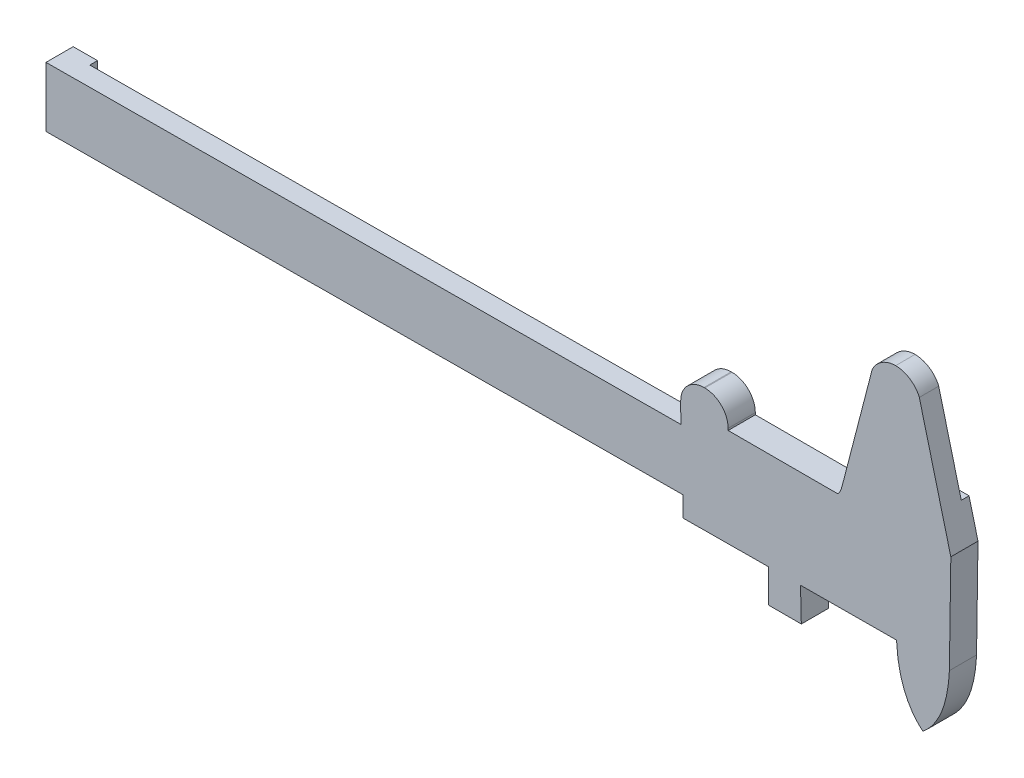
ISO-10303-21;
HEADER;
FILE_DESCRIPTION(('STEP AP214'),'2;1');
FILE_NAME('part.step','',(''),(''),'','','');
FILE_SCHEMA(('AUTOMOTIVE_DESIGN { 1 0 10303 214 1 1 1 1 }'));
ENDSEC;
DATA;
#1=APPLICATION_CONTEXT('core data for automotive mechanical design processes');
#2=APPLICATION_PROTOCOL_DEFINITION('international standard','automotive_design',2000,#1);
#3=PRODUCT_CONTEXT('',#1,'mechanical');
#4=PRODUCT('Part','Part','',(#3));
#5=PRODUCT_RELATED_PRODUCT_CATEGORY('part','',(#4));
#6=PRODUCT_DEFINITION_FORMATION('','',#4);
#7=PRODUCT_DEFINITION_CONTEXT('part definition',#1,'design');
#8=PRODUCT_DEFINITION('design','',#6,#7);
#9=PRODUCT_DEFINITION_SHAPE('','',#8);
#10=(LENGTH_UNIT() NAMED_UNIT(*) SI_UNIT(.MILLI.,.METRE.));
#11=(NAMED_UNIT(*) PLANE_ANGLE_UNIT() SI_UNIT($,.RADIAN.));
#12=(NAMED_UNIT(*) SI_UNIT($,.STERADIAN.) SOLID_ANGLE_UNIT());
#13=UNCERTAINTY_MEASURE_WITH_UNIT(LENGTH_MEASURE(1.E-05),#10,'distance_accuracy_value','');
#14=(GEOMETRIC_REPRESENTATION_CONTEXT(3) GLOBAL_UNCERTAINTY_ASSIGNED_CONTEXT((#13)) GLOBAL_UNIT_ASSIGNED_CONTEXT((#10,
#11,#12)) REPRESENTATION_CONTEXT('',''));
#15=CARTESIAN_POINT('',(0.,0.,0.));
#16=DIRECTION('',(0.,0.,1.));
#17=DIRECTION('',(1.,0.,0.));
#18=AXIS2_PLACEMENT_3D('',#15,#16,#17);
#19=CARTESIAN_POINT('',(234.515118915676,70.7303857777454,7.));
#20=CARTESIAN_POINT('',(233.58508014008,73.106536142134,7.));
#21=CARTESIAN_POINT('',(231.015741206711,74.7747070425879,7.));
#22=CARTESIAN_POINT('',(228.42526925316,74.7747070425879,7.));
#23=B_SPLINE_CURVE_WITH_KNOTS('',3,(#19,#20,#21,#22),.UNSPECIFIED.,.F.,.F.,(4,4),(0.,1.),.UNSPECIFIED.);
#24=DIRECTION('',(0.,0.,-1.));
#25=VECTOR('',#24,1.);
#26=SURFACE_OF_LINEAR_EXTRUSION('',#23,#25);
#27=CARTESIAN_POINT('',(228.42526925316,74.7747070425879,2.));
#28=CARTESIAN_POINT('',(228.61284091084,74.774697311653,2.));
#29=CARTESIAN_POINT('',(228.800236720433,74.7659577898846,2.));
#30=CARTESIAN_POINT('',(229.173447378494,74.731744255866,2.));
#31=CARTESIAN_POINT('',(229.35926268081,74.7062752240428,2.));
#32=CARTESIAN_POINT('',(229.911185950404,74.6061207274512,2.));
#33=CARTESIAN_POINT('',(230.273291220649,74.507675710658,2.));
#34=CARTESIAN_POINT('',(230.799795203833,74.3174038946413,2.));
#35=CARTESIAN_POINT('',(230.972360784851,74.2469685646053,2.));
#36=CARTESIAN_POINT('',(231.31132230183,74.0925268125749,2.));
#37=CARTESIAN_POINT('',(231.477717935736,74.0085197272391,2.));
#38=CARTESIAN_POINT('',(231.966724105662,73.7366141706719,2.));
#39=CARTESIAN_POINT('',(232.278760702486,73.5289743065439,2.));
#40=CARTESIAN_POINT('',(232.725643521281,73.1759121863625,2.));
#41=CARTESIAN_POINT('',(232.874405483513,73.0476111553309,2.));
#42=CARTESIAN_POINT('',(233.160107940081,72.7782908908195,2.));
#43=CARTESIAN_POINT('',(233.297046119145,72.6372691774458,2.));
#44=CARTESIAN_POINT('',(233.557015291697,72.3437063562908,2.));
#45=CARTESIAN_POINT('',(233.680087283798,72.1912015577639,2.));
#46=CARTESIAN_POINT('',(233.911045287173,71.8752017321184,2.));
#47=CARTESIAN_POINT('',(234.018941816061,71.7117144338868,2.));
#48=CARTESIAN_POINT('',(234.195101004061,71.4132749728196,2.));
#49=CARTESIAN_POINT('',(234.266786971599,71.2803362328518,2.));
#50=CARTESIAN_POINT('',(234.399294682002,71.0091723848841,2.));
#51=CARTESIAN_POINT('',(234.460117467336,70.8709477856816,2.));
#52=CARTESIAN_POINT('',(234.515118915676,70.7303857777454,2.));
#53=B_SPLINE_CURVE_WITH_KNOTS('',3,(#27,#28,#29,#30,#31,#32,#33,#34,#35,#36,#37,#38,#39,#40,#41,
#42,#43,#44,#45,#46,#47,#48,#49,#50,#51,#52),.UNSPECIFIED.,.F.,.F.,(4,2,2,2,2,2,2,2,2,2,2,2,4),
(0.,0.562195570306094,1.12422384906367,2.24378081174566,2.8024713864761,3.36118927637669,
4.47986663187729,5.06861782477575,5.65748404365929,6.24456072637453,6.83122849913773,
7.28387239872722,7.73647283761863),.UNSPECIFIED.);
#54=CARTESIAN_POINT('',(228.42526925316,74.7747070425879,2.));
#55=VERTEX_POINT('',#54);
#56=CARTESIAN_POINT('',(234.515118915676,70.7303857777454,2.));
#57=VERTEX_POINT('',#56);
#58=EDGE_CURVE('E236',#55,#57,#53,.T.);
#59=ORIENTED_EDGE('',*,*,#58,.F.);
#60=DIRECTION('',(0.,0.,-1.));
#61=VECTOR('',#60,1.);
#62=CARTESIAN_POINT('',(228.42526925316,74.7747070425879,7.));
#63=LINE('',#62,#61);
#64=CARTESIAN_POINT('',(228.42526925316,74.7747070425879,7.));
#65=VERTEX_POINT('',#64);
#66=EDGE_CURVE('E431',#65,#55,#63,.T.);
#67=ORIENTED_EDGE('',*,*,#66,.F.);
#68=CARTESIAN_POINT('',(234.515118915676,70.7303857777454,7.));
#69=VERTEX_POINT('',#68);
#70=EDGE_CURVE('E375',#69,#65,#23,.T.);
#71=ORIENTED_EDGE('',*,*,#70,.F.);
#72=DIRECTION('',(0.,0.,-1.));
#73=VECTOR('',#72,1.);
#74=CARTESIAN_POINT('',(234.515118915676,70.7303857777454,7.));
#75=LINE('',#74,#73);
#76=EDGE_CURVE('E556',#69,#57,#75,.T.);
#77=ORIENTED_EDGE('',*,*,#76,.T.);
#78=EDGE_LOOP('',(#59,#67,#71,#77));
#79=FACE_BOUND('',#78,.T.);
#80=ADVANCED_FACE('F39',(#79),#26,.F.);
#81=CARTESIAN_POINT('',(228.42526925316,74.7747070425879,7.));
#82=CARTESIAN_POINT('',(225.834797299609,74.7747070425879,7.));
#83=CARTESIAN_POINT('',(223.265458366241,73.106536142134,7.));
#84=CARTESIAN_POINT('',(222.335419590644,70.7303857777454,7.));
#85=B_SPLINE_CURVE_WITH_KNOTS('',3,(#81,#82,#83,#84),.UNSPECIFIED.,.F.,.F.,(4,4),(0.,1.),.UNSPECIFIED.);
#86=DIRECTION('',(0.,0.,-1.));
#87=VECTOR('',#86,1.);
#88=SURFACE_OF_LINEAR_EXTRUSION('',#85,#87);
#89=CARTESIAN_POINT('',(222.335419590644,70.7303857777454,2.));
#90=CARTESIAN_POINT('',(222.399511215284,70.8942071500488,2.));
#91=CARTESIAN_POINT('',(222.471522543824,71.0548455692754,2.));
#92=CARTESIAN_POINT('',(222.630026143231,71.3686158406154,2.));
#93=CARTESIAN_POINT('',(222.716503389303,71.5217552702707,2.));
#94=CARTESIAN_POINT('',(222.902198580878,71.8188980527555,2.));
#95=CARTESIAN_POINT('',(223.001342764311,71.9629476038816,2.));
#96=CARTESIAN_POINT('',(223.211461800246,72.2421308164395,2.));
#97=CARTESIAN_POINT('',(223.322440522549,72.3772615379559,2.));
#98=CARTESIAN_POINT('',(223.670449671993,72.7673552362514,2.));
#99=CARTESIAN_POINT('',(223.92345071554,73.0084311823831,2.));
#100=CARTESIAN_POINT('',(224.328042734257,73.3388756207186,2.));
#101=CARTESIAN_POINT('',(224.46727108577,73.4439363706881,2.));
#102=CARTESIAN_POINT('',(224.75342370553,73.6434155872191,2.));
#103=CARTESIAN_POINT('',(224.900356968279,73.7378211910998,2.));
#104=CARTESIAN_POINT('',(225.378110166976,74.0201243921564,2.));
#105=CARTESIAN_POINT('',(225.721581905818,74.1870949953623,2.));
#106=CARTESIAN_POINT('',(226.431208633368,74.4622961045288,2.));
#107=CARTESIAN_POINT('',(226.797342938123,74.570579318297,2.));
#108=CARTESIAN_POINT('',(227.272931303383,74.6674277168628,2.));
#109=CARTESIAN_POINT('',(227.37672053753,74.6859657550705,2.));
#110=CARTESIAN_POINT('',(227.585004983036,74.7179072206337,2.));
#111=CARTESIAN_POINT('',(227.689499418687,74.7313155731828,2.));
#112=CARTESIAN_POINT('',(227.899010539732,74.7528737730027,2.));
#113=CARTESIAN_POINT('',(228.004027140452,74.7610244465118,2.));
#114=CARTESIAN_POINT('',(228.214448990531,74.7719445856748,2.));
#115=CARTESIAN_POINT('',(228.31985453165,74.7747084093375,2.));
#116=CARTESIAN_POINT('',(228.42526925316,74.7747070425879,2.));
#117=B_SPLINE_CURVE_WITH_KNOTS('',3,(#89,#90,#91,#92,#93,#94,#95,#96,#97,#98,#99,#100,#101,#102,
#103,#104,#105,#106,#107,#108,#109,#110,#111,#112,#113,#114,#115,#116),.UNSPECIFIED.,.F.,.F.,(4,
2,2,2,2,2,2,2,2,2,2,2,2,4),(0.,0.527414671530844,1.05428491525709,1.57821613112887,
2.10231919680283,3.1455656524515,3.66844808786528,4.19195513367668,5.33237842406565,
6.47177578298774,6.78799240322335,7.10390464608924,7.41976723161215,7.73596046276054),.UNSPECIFIED.);
#118=CARTESIAN_POINT('',(222.335419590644,70.7303857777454,2.));
#119=VERTEX_POINT('',#118);
#120=EDGE_CURVE('E282',#119,#55,#117,.T.);
#121=ORIENTED_EDGE('',*,*,#120,.F.);
#122=DIRECTION('',(0.,0.,-1.));
#123=VECTOR('',#122,1.);
#124=CARTESIAN_POINT('',(222.335419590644,70.7303857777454,7.));
#125=LINE('',#124,#123);
#126=CARTESIAN_POINT('',(222.335419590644,70.7303857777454,7.));
#127=VERTEX_POINT('',#126);
#128=EDGE_CURVE('E426',#127,#119,#125,.T.);
#129=ORIENTED_EDGE('',*,*,#128,.F.);
#130=EDGE_CURVE('E381',#65,#127,#85,.T.);
#131=ORIENTED_EDGE('',*,*,#130,.F.);
#132=ORIENTED_EDGE('',*,*,#66,.T.);
#133=EDGE_LOOP('',(#121,#129,#131,#132));
#134=FACE_BOUND('',#133,.T.);
#135=ADVANCED_FACE('F363',(#134),#88,.F.);
#136=CARTESIAN_POINT('',(230.283744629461,4.42310895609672,0.));
#137=DIRECTION('',(0.,0.,-1.));
#138=DIRECTION('',(-1.,0.,0.));
#139=AXIS2_PLACEMENT_3D('',#136,#137,#138);
#140=PLANE('',#139);
#141=DIRECTION('',(-1.,0.,0.));
#142=VECTOR('',#141,1.);
#143=CARTESIAN_POINT('',(240.325064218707,48.1834965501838,0.));
#144=LINE('',#143,#142);
#145=CARTESIAN_POINT('',(240.325064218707,48.1834965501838,0.));
#146=VERTEX_POINT('',#145);
#147=CARTESIAN_POINT('',(216.491232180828,48.1834965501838,0.));
#148=VERTEX_POINT('',#147);
#149=EDGE_CURVE('E433',#146,#148,#144,.T.);
#150=ORIENTED_EDGE('',*,*,#149,.F.);
#151=DIRECTION('',(-0.249531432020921,0.968366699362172,0.));
#152=VECTOR('',#151,1.);
#153=CARTESIAN_POINT('',(234.515118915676,70.7303857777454,0.));
#154=LINE('',#153,#152);
#155=CARTESIAN_POINT('',(242.634280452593,39.2220279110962,0.));
#156=VERTEX_POINT('',#155);
#157=EDGE_CURVE('E246',#156,#146,#154,.T.);
#158=ORIENTED_EDGE('',*,*,#157,.F.);
#159=DIRECTION('',(0.0146565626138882,0.999892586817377,0.));
#160=VECTOR('',#159,1.);
#161=CARTESIAN_POINT('',(242.634280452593,39.2220279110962,0.));
#162=LINE('',#161,#160);
#163=CARTESIAN_POINT('',(242.259332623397,13.6425271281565,0.));
#164=VERTEX_POINT('',#163);
#165=EDGE_CURVE('E450',#164,#156,#162,.T.);
#166=ORIENTED_EDGE('',*,*,#165,.F.);
#167=CARTESIAN_POINT('',(235.449522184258,-3.30660845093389,0.));
#168=CARTESIAN_POINT('',(240.450788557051,0.848930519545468,0.));
#169=CARTESIAN_POINT('',(241.95372581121,7.50072047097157,0.));
#170=CARTESIAN_POINT('',(242.259332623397,13.6425271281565,0.));
#171=B_SPLINE_CURVE_WITH_KNOTS('',3,(#167,#168,#169,#170),.UNSPECIFIED.,.F.,.F.,(4,4),(0.,1.),.UNSPECIFIED.);
#172=CARTESIAN_POINT('',(235.449522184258,-3.30660845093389,0.));
#173=VERTEX_POINT('',#172);
#174=EDGE_CURVE('E637',#173,#164,#171,.T.);
#175=ORIENTED_EDGE('',*,*,#174,.F.);
#176=CARTESIAN_POINT('',(228.639711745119,13.6425271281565,0.));
#177=CARTESIAN_POINT('',(228.945318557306,7.50072047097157,0.));
#178=CARTESIAN_POINT('',(230.448255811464,0.848930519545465,0.));
#179=CARTESIAN_POINT('',(235.449522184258,-3.30660845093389,0.));
#180=B_SPLINE_CURVE_WITH_KNOTS('',3,(#176,#177,#178,#179),.UNSPECIFIED.,.F.,.F.,(4,4),(0.,1.),.UNSPECIFIED.);
#181=CARTESIAN_POINT('',(228.639711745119,13.6425271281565,0.));
#182=VERTEX_POINT('',#181);
#183=EDGE_CURVE('E314',#182,#173,#180,.T.);
#184=ORIENTED_EDGE('',*,*,#183,.F.);
#185=DIRECTION('',(0.999988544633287,0.00478650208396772,0.));
#186=VECTOR('',#185,1.);
#187=CARTESIAN_POINT('',(228.639711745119,13.6425271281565,0.));
#188=LINE('',#187,#186);
#189=CARTESIAN_POINT('',(203.908091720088,13.5241478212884,0.));
#190=VERTEX_POINT('',#189);
#191=EDGE_CURVE('E332',#190,#182,#188,.T.);
#192=ORIENTED_EDGE('',*,*,#191,.F.);
#193=DIRECTION('',(-0.0244575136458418,0.999700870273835,0.));
#194=VECTOR('',#193,1.);
#195=CARTESIAN_POINT('',(204.117476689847,4.96553718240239,0.));
#196=LINE('',#195,#194);
#197=CARTESIAN_POINT('',(204.117476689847,4.96553718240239,0.));
#198=VERTEX_POINT('',#197);
#199=EDGE_CURVE('E495',#198,#190,#196,.T.);
#200=ORIENTED_EDGE('',*,*,#199,.F.);
#201=DIRECTION('',(1.,0.,0.));
#202=VECTOR('',#201,1.);
#203=CARTESIAN_POINT('',(195.684032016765,4.96553718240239,0.));
#204=LINE('',#203,#202);
#205=CARTESIAN_POINT('',(195.684032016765,4.96553718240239,0.));
#206=VERTEX_POINT('',#205);
#207=EDGE_CURVE('E492',#206,#198,#204,.T.);
#208=ORIENTED_EDGE('',*,*,#207,.F.);
#209=DIRECTION('',(0.00676219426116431,-0.999977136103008,0.));
#210=VECTOR('',#209,1.);
#211=CARTESIAN_POINT('',(195.626213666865,13.5155766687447,0.));
#212=LINE('',#211,#210);
#213=CARTESIAN_POINT('',(195.626213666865,13.5155766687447,0.));
#214=VERTEX_POINT('',#213);
#215=EDGE_CURVE('E489',#214,#206,#212,.T.);
#216=ORIENTED_EDGE('',*,*,#215,.F.);
#217=DIRECTION('',(0.999977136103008,0.00676219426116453,0.));
#218=VECTOR('',#217,1.);
#219=CARTESIAN_POINT('',(195.626213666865,13.5155766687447,0.));
#220=LINE('',#219,#218);
#221=CARTESIAN_POINT('',(173.639711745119,13.3668962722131,0.));
#222=VERTEX_POINT('',#221);
#223=EDGE_CURVE('E486',#222,#214,#220,.T.);
#224=ORIENTED_EDGE('',*,*,#223,.F.);
#225=DIRECTION('',(0.,-1.,0.));
#226=VECTOR('',#225,1.);
#227=CARTESIAN_POINT('',(173.639711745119,13.3668962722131,0.));
#228=LINE('',#227,#226);
#229=CARTESIAN_POINT('',(173.639711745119,18.5658586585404,0.));
#230=VERTEX_POINT('',#229);
#231=EDGE_CURVE('E483',#230,#222,#228,.T.);
#232=ORIENTED_EDGE('',*,*,#231,.F.);
#233=DIRECTION('',(0.03661170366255,-0.99932956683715,0.));
#234=VECTOR('',#233,1.);
#235=CARTESIAN_POINT('',(173.639711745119,18.5658586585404,0.));
#236=LINE('',#235,#234);
#237=CARTESIAN_POINT('',(173.07482676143,33.9845966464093,0.));
#238=VERTEX_POINT('',#237);
#239=EDGE_CURVE('E295',#238,#230,#236,.T.);
#240=ORIENTED_EDGE('',*,*,#239,.F.);
#241=DIRECTION('',(0.00609997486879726,-0.999981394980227,0.));
#242=VECTOR('',#241,1.);
#243=CARTESIAN_POINT('',(173.07482676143,33.9845966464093,0.));
#244=LINE('',#243,#242);
#245=CARTESIAN_POINT('',(173.043210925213,39.167445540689,0.));
#246=VERTEX_POINT('',#245);
#247=EDGE_CURVE('E469',#246,#238,#244,.T.);
#248=ORIENTED_EDGE('',*,*,#247,.F.);
#249=CARTESIAN_POINT('',(179.043099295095,39.2040453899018,0.));
#250=DIRECTION('',(0.,0.,-1.));
#251=DIRECTION('',(-1.,0.,0.));
#252=AXIS2_PLACEMENT_3D('',#249,#250,#251);
#253=CIRCLE('',#252,6.);
#254=CARTESIAN_POINT('',(179.043099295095,45.2040453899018,0.));
#255=VERTEX_POINT('',#254);
#256=EDGE_CURVE('E577',#246,#255,#253,.T.);
#257=ORIENTED_EDGE('',*,*,#256,.T.);
#258=DIRECTION('',(-1.,0.,0.));
#259=VECTOR('',#258,1.);
#260=CARTESIAN_POINT('',(173.006387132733,45.2040453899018,0.));
#261=LINE('',#260,#259);
#262=CARTESIAN_POINT('',(179.266703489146,45.2040453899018,0.));
#263=VERTEX_POINT('',#262);
#264=EDGE_CURVE('E465',#263,#255,#261,.T.);
#265=ORIENTED_EDGE('',*,*,#264,.F.);
#266=CARTESIAN_POINT('',(179.266703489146,39.2040453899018,0.));
#267=DIRECTION('',(0.,0.,-1.));
#268=DIRECTION('',(-1.,0.,0.));
#269=AXIS2_PLACEMENT_3D('',#266,#267,#268);
#270=CIRCLE('',#269,6.);
#271=CARTESIAN_POINT('',(185.266703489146,39.2040453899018,0.));
#272=VERTEX_POINT('',#271);
#273=EDGE_CURVE('E574',#263,#272,#270,.T.);
#274=ORIENTED_EDGE('',*,*,#273,.T.);
#275=DIRECTION('',(0.,1.,0.));
#276=VECTOR('',#275,1.);
#277=CARTESIAN_POINT('',(185.266703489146,45.2040453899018,0.));
#278=LINE('',#277,#276);
#279=CARTESIAN_POINT('',(185.266703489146,38.7228694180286,0.));
#280=VERTEX_POINT('',#279);
#281=EDGE_CURVE('E461',#280,#272,#278,.T.);
#282=ORIENTED_EDGE('',*,*,#281,.F.);
#283=DIRECTION('',(-1.,0.,0.));
#284=VECTOR('',#283,1.);
#285=CARTESIAN_POINT('',(185.266703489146,38.7228694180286,0.));
#286=LINE('',#285,#284);
#287=CARTESIAN_POINT('',(213.478853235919,38.7228694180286,0.));
#288=VERTEX_POINT('',#287);
#289=EDGE_CURVE('E448',#288,#280,#286,.T.);
#290=ORIENTED_EDGE('',*,*,#289,.F.);
#291=CARTESIAN_POINT('',(214.677418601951,41.185799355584,0.));
#292=CARTESIAN_POINT('',(214.439289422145,40.267096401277,0.));
#293=CARTESIAN_POINT('',(214.230563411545,39.4059765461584,0.));
#294=CARTESIAN_POINT('',(213.478853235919,38.7228694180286,0.));
#295=B_SPLINE_CURVE_WITH_KNOTS('',3,(#291,#292,#293,#294),.UNSPECIFIED.,.F.,.F.,(4,4),(0.,1.),.UNSPECIFIED.);
#296=CARTESIAN_POINT('',(214.677418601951,41.185799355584,0.));
#297=VERTEX_POINT('',#296);
#298=EDGE_CURVE('E441',#297,#288,#295,.T.);
#299=ORIENTED_EDGE('',*,*,#298,.F.);
#300=DIRECTION('',(-0.250909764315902,-0.96801048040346,0.));
#301=VECTOR('',#300,1.);
#302=CARTESIAN_POINT('',(222.335419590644,70.7303857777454,0.));
#303=LINE('',#302,#301);
#304=EDGE_CURVE('E439',#148,#297,#303,.T.);
#305=ORIENTED_EDGE('',*,*,#304,.F.);
#306=EDGE_LOOP('',(#150,#158,#166,#175,#184,#192,#200,#208,#216,#224,#232,#240,#248,#257,#265,
#274,#282,#290,#299,#305));
#307=FACE_BOUND('',#306,.T.);
#308=ADVANCED_FACE('F345',(#307),#140,.T.);
#309=CARTESIAN_POINT('',(228.639711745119,13.6425271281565,7.));
#310=CARTESIAN_POINT('',(228.945318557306,7.50072047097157,7.));
#311=CARTESIAN_POINT('',(230.448255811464,0.848930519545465,7.));
#312=CARTESIAN_POINT('',(235.449522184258,-3.30660845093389,7.));
#313=B_SPLINE_CURVE_WITH_KNOTS('',3,(#309,#310,#311,#312),.UNSPECIFIED.,.F.,.F.,(4,4),(0.,1.),.UNSPECIFIED.);
#314=DIRECTION('',(0.,0.,-1.));
#315=VECTOR('',#314,1.);
#316=SURFACE_OF_LINEAR_EXTRUSION('',#313,#315);
#317=ORIENTED_EDGE('',*,*,#183,.T.);
#318=DIRECTION('',(0.,0.,-1.));
#319=VECTOR('',#318,1.);
#320=CARTESIAN_POINT('',(235.449522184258,-3.30660845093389,7.));
#321=LINE('',#320,#319);
#322=CARTESIAN_POINT('',(235.449522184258,-3.30660845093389,7.));
#323=VERTEX_POINT('',#322);
#324=EDGE_CURVE('E566',#323,#173,#321,.T.);
#325=ORIENTED_EDGE('',*,*,#324,.F.);
#326=CARTESIAN_POINT('',(228.639711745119,13.6425271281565,7.));
#327=VERTEX_POINT('',#326);
#328=EDGE_CURVE('E324',#327,#323,#313,.T.);
#329=ORIENTED_EDGE('',*,*,#328,.F.);
#330=DIRECTION('',(0.,0.,-1.));
#331=VECTOR('',#330,1.);
#332=CARTESIAN_POINT('',(228.639711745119,13.6425271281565,7.));
#333=LINE('',#332,#331);
#334=EDGE_CURVE('E500',#327,#182,#333,.T.);
#335=ORIENTED_EDGE('',*,*,#334,.T.);
#336=EDGE_LOOP('',(#317,#325,#329,#335));
#337=FACE_BOUND('',#336,.T.);
#338=ADVANCED_FACE('F341',(#337),#316,.F.);
#339=CARTESIAN_POINT('',(235.449522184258,-3.30660845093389,7.));
#340=CARTESIAN_POINT('',(240.450788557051,0.848930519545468,7.));
#341=CARTESIAN_POINT('',(241.95372581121,7.50072047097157,7.));
#342=CARTESIAN_POINT('',(242.259332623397,13.6425271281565,7.));
#343=B_SPLINE_CURVE_WITH_KNOTS('',3,(#339,#340,#341,#342),.UNSPECIFIED.,.F.,.F.,(4,4),(0.,1.),.UNSPECIFIED.);
#344=DIRECTION('',(0.,0.,-1.));
#345=VECTOR('',#344,1.);
#346=SURFACE_OF_LINEAR_EXTRUSION('',#343,#345);
#347=ORIENTED_EDGE('',*,*,#174,.T.);
#348=DIRECTION('',(0.,0.,-1.));
#349=VECTOR('',#348,1.);
#350=CARTESIAN_POINT('',(242.259332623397,13.6425271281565,7.));
#351=LINE('',#350,#349);
#352=CARTESIAN_POINT('',(242.259332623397,13.6425271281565,7.));
#353=VERTEX_POINT('',#352);
#354=EDGE_CURVE('E562',#353,#164,#351,.T.);
#355=ORIENTED_EDGE('',*,*,#354,.F.);
#356=EDGE_CURVE('E331',#323,#353,#343,.T.);
#357=ORIENTED_EDGE('',*,*,#356,.F.);
#358=ORIENTED_EDGE('',*,*,#324,.T.);
#359=EDGE_LOOP('',(#347,#355,#357,#358));
#360=FACE_BOUND('',#359,.T.);
#361=ADVANCED_FACE('F344',(#360),#346,.F.);
#362=CARTESIAN_POINT('',(242.634280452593,39.2220279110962,7.));
#363=DIRECTION('',(-0.999892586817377,0.0146565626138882,0.));
#364=DIRECTION('',(-0.0146565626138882,-0.999892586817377,0.));
#365=AXIS2_PLACEMENT_3D('',#362,#363,#364);
#366=PLANE('',#365);
#367=ORIENTED_EDGE('',*,*,#165,.T.);
#368=DIRECTION('',(0.,0.,-1.));
#369=VECTOR('',#368,1.);
#370=CARTESIAN_POINT('',(242.634280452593,39.2220279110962,7.));
#371=LINE('',#370,#369);
#372=CARTESIAN_POINT('',(242.634280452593,39.2220279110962,7.));
#373=VERTEX_POINT('',#372);
#374=EDGE_CURVE('E559',#373,#156,#371,.T.);
#375=ORIENTED_EDGE('',*,*,#374,.F.);
#376=DIRECTION('',(0.0146565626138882,0.999892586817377,0.));
#377=VECTOR('',#376,1.);
#378=CARTESIAN_POINT('',(242.634280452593,39.2220279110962,7.));
#379=LINE('',#378,#377);
#380=EDGE_CURVE('E629',#353,#373,#379,.T.);
#381=ORIENTED_EDGE('',*,*,#380,.F.);
#382=ORIENTED_EDGE('',*,*,#354,.T.);
#383=EDGE_LOOP('',(#367,#375,#381,#382));
#384=FACE_BOUND('',#383,.T.);
#385=ADVANCED_FACE('F421',(#384),#366,.F.);
#386=CARTESIAN_POINT('',(234.515118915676,70.7303857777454,7.));
#387=DIRECTION('',(-0.968366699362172,-0.249531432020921,0.));
#388=DIRECTION('',(0.249531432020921,-0.968366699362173,0.));
#389=AXIS2_PLACEMENT_3D('',#386,#387,#388);
#390=PLANE('',#389);
#391=ORIENTED_EDGE('',*,*,#157,.T.);
#392=DIRECTION('',(0.,0.,-1.));
#393=VECTOR('',#392,1.);
#394=CARTESIAN_POINT('',(240.325064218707,48.1834965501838,2.));
#395=LINE('',#394,#393);
#396=CARTESIAN_POINT('',(240.325064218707,48.1834965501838,2.));
#397=VERTEX_POINT('',#396);
#398=EDGE_CURVE('E224',#397,#146,#395,.T.);
#399=ORIENTED_EDGE('',*,*,#398,.F.);
#400=DIRECTION('',(0.249531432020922,-0.968366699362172,0.));
#401=VECTOR('',#400,1.);
#402=CARTESIAN_POINT('',(240.325064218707,48.1834965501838,2.));
#403=LINE('',#402,#401);
#404=EDGE_CURVE('E231',#57,#397,#403,.T.);
#405=ORIENTED_EDGE('',*,*,#404,.F.);
#406=ORIENTED_EDGE('',*,*,#76,.F.);
#407=DIRECTION('',(-0.249531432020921,0.968366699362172,0.));
#408=VECTOR('',#407,1.);
#409=CARTESIAN_POINT('',(234.515118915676,70.7303857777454,7.));
#410=LINE('',#409,#408);
#411=EDGE_CURVE('E382',#373,#69,#410,.T.);
#412=ORIENTED_EDGE('',*,*,#411,.F.);
#413=ORIENTED_EDGE('',*,*,#374,.T.);
#414=EDGE_LOOP('',(#391,#399,#405,#406,#412,#413));
#415=FACE_BOUND('',#414,.T.);
#416=ADVANCED_FACE('F243',(#415),#390,.F.);
#417=CARTESIAN_POINT('',(222.335419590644,70.7303857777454,7.));
#418=DIRECTION('',(0.96801048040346,-0.250909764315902,0.));
#419=DIRECTION('',(0.250909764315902,0.96801048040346,0.));
#420=AXIS2_PLACEMENT_3D('',#417,#418,#419);
#421=PLANE('',#420);
#422=DIRECTION('',(0.250909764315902,0.96801048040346,0.));
#423=VECTOR('',#422,1.);
#424=CARTESIAN_POINT('',(222.335419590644,70.7303857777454,2.));
#425=LINE('',#424,#423);
#426=CARTESIAN_POINT('',(216.491232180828,48.1834965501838,2.));
#427=VERTEX_POINT('',#426);
#428=EDGE_CURVE('E230',#427,#119,#425,.T.);
#429=ORIENTED_EDGE('',*,*,#428,.F.);
#430=DIRECTION('',(0.,0.,-1.));
#431=VECTOR('',#430,1.);
#432=CARTESIAN_POINT('',(216.491232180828,48.1834965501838,2.));
#433=LINE('',#432,#431);
#434=EDGE_CURVE('E227',#427,#148,#433,.T.);
#435=ORIENTED_EDGE('',*,*,#434,.T.);
#436=ORIENTED_EDGE('',*,*,#304,.T.);
#437=DIRECTION('',(0.,0.,-1.));
#438=VECTOR('',#437,1.);
#439=CARTESIAN_POINT('',(214.677418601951,41.185799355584,7.));
#440=LINE('',#439,#438);
#441=CARTESIAN_POINT('',(214.677418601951,41.185799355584,7.));
#442=VERTEX_POINT('',#441);
#443=EDGE_CURVE('E549',#442,#297,#440,.T.);
#444=ORIENTED_EDGE('',*,*,#443,.F.);
#445=DIRECTION('',(-0.250909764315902,-0.96801048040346,0.));
#446=VECTOR('',#445,1.);
#447=CARTESIAN_POINT('',(222.335419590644,70.7303857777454,7.));
#448=LINE('',#447,#446);
#449=EDGE_CURVE('E391',#127,#442,#448,.T.);
#450=ORIENTED_EDGE('',*,*,#449,.F.);
#451=ORIENTED_EDGE('',*,*,#128,.T.);
#452=EDGE_LOOP('',(#429,#435,#436,#444,#450,#451));
#453=FACE_BOUND('',#452,.T.);
#454=ADVANCED_FACE('F413',(#453),#421,.F.);
#455=CARTESIAN_POINT('',(214.677418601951,41.185799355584,7.));
#456=CARTESIAN_POINT('',(214.439289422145,40.267096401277,7.));
#457=CARTESIAN_POINT('',(214.230563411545,39.4059765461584,7.));
#458=CARTESIAN_POINT('',(213.478853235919,38.7228694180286,7.));
#459=B_SPLINE_CURVE_WITH_KNOTS('',3,(#455,#456,#457,#458),.UNSPECIFIED.,.F.,.F.,(4,4),(0.,1.),.UNSPECIFIED.);
#460=DIRECTION('',(0.,0.,-1.));
#461=VECTOR('',#460,1.);
#462=SURFACE_OF_LINEAR_EXTRUSION('',#459,#461);
#463=ORIENTED_EDGE('',*,*,#298,.T.);
#464=DIRECTION('',(0.,0.,-1.));
#465=VECTOR('',#464,1.);
#466=CARTESIAN_POINT('',(213.478853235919,38.7228694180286,7.));
#467=LINE('',#466,#465);
#468=CARTESIAN_POINT('',(213.478853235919,38.7228694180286,7.));
#469=VERTEX_POINT('',#468);
#470=EDGE_CURVE('E545',#469,#288,#467,.T.);
#471=ORIENTED_EDGE('',*,*,#470,.F.);
#472=EDGE_CURVE('E397',#442,#469,#459,.T.);
#473=ORIENTED_EDGE('',*,*,#472,.F.);
#474=ORIENTED_EDGE('',*,*,#443,.T.);
#475=EDGE_LOOP('',(#463,#471,#473,#474));
#476=FACE_BOUND('',#475,.T.);
#477=ADVANCED_FACE('F409',(#476),#462,.F.);
#478=CARTESIAN_POINT('',(185.266703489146,38.7228694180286,7.));
#479=DIRECTION('',(0.,-1.,0.));
#480=DIRECTION('',(0.,0.,-1.));
#481=AXIS2_PLACEMENT_3D('',#478,#479,#480);
#482=PLANE('',#481);
#483=ORIENTED_EDGE('',*,*,#289,.T.);
#484=DIRECTION('',(0.,0.,-1.));
#485=VECTOR('',#484,1.);
#486=CARTESIAN_POINT('',(185.266703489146,38.7228694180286,7.));
#487=LINE('',#486,#485);
#488=CARTESIAN_POINT('',(185.266703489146,38.7228694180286,7.));
#489=VERTEX_POINT('',#488);
#490=EDGE_CURVE('E541',#489,#280,#487,.T.);
#491=ORIENTED_EDGE('',*,*,#490,.F.);
#492=DIRECTION('',(-1.,0.,0.));
#493=VECTOR('',#492,1.);
#494=CARTESIAN_POINT('',(185.266703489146,38.7228694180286,7.));
#495=LINE('',#494,#493);
#496=EDGE_CURVE('E403',#469,#489,#495,.T.);
#497=ORIENTED_EDGE('',*,*,#496,.F.);
#498=ORIENTED_EDGE('',*,*,#470,.T.);
#499=EDGE_LOOP('',(#483,#491,#497,#498));
#500=FACE_BOUND('',#499,.T.);
#501=ADVANCED_FACE('F412',(#500),#482,.F.);
#502=CARTESIAN_POINT('',(185.266703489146,45.2040453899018,7.));
#503=DIRECTION('',(-1.,0.,0.));
#504=DIRECTION('',(0.,0.,1.));
#505=AXIS2_PLACEMENT_3D('',#502,#503,#504);
#506=PLANE('',#505);
#507=ORIENTED_EDGE('',*,*,#281,.T.);
#508=DIRECTION('',(0.,0.,-1.));
#509=VECTOR('',#508,1.);
#510=CARTESIAN_POINT('',(185.266703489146,39.2040453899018,7.));
#511=LINE('',#510,#509);
#512=CARTESIAN_POINT('',(185.266703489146,39.2040453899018,7.));
#513=VERTEX_POINT('',#512);
#514=EDGE_CURVE('E11',#272,#513,#511,.F.);
#515=ORIENTED_EDGE('',*,*,#514,.T.);
#516=DIRECTION('',(0.,1.,0.));
#517=VECTOR('',#516,1.);
#518=CARTESIAN_POINT('',(185.266703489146,45.2040453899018,7.));
#519=LINE('',#518,#517);
#520=EDGE_CURVE('E620',#489,#513,#519,.T.);
#521=ORIENTED_EDGE('',*,*,#520,.F.);
#522=ORIENTED_EDGE('',*,*,#490,.T.);
#523=EDGE_LOOP('',(#507,#515,#521,#522));
#524=FACE_BOUND('',#523,.T.);
#525=ADVANCED_FACE('F616',(#524),#506,.F.);
#526=CARTESIAN_POINT('',(173.006387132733,45.2040453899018,7.));
#527=DIRECTION('',(0.,-1.,0.));
#528=DIRECTION('',(0.,0.,-1.));
#529=AXIS2_PLACEMENT_3D('',#526,#527,#528);
#530=PLANE('',#529);
#531=ORIENTED_EDGE('',*,*,#264,.T.);
#532=DIRECTION('',(0.,0.,-1.));
#533=VECTOR('',#532,1.);
#534=CARTESIAN_POINT('',(179.043099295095,45.2040453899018,7.));
#535=LINE('',#534,#533);
#536=CARTESIAN_POINT('',(179.043099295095,45.2040453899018,7.));
#537=VERTEX_POINT('',#536);
#538=EDGE_CURVE('E584',#255,#537,#535,.F.);
#539=ORIENTED_EDGE('',*,*,#538,.T.);
#540=DIRECTION('',(-1.,0.,0.));
#541=VECTOR('',#540,1.);
#542=CARTESIAN_POINT('',(173.006387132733,45.2040453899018,7.));
#543=LINE('',#542,#541);
#544=CARTESIAN_POINT('',(179.266703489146,45.2040453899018,7.));
#545=VERTEX_POINT('',#544);
#546=EDGE_CURVE('E596',#545,#537,#543,.T.);
#547=ORIENTED_EDGE('',*,*,#546,.F.);
#548=DIRECTION('',(0.,0.,-1.));
#549=VECTOR('',#548,1.);
#550=CARTESIAN_POINT('',(179.266703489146,45.2040453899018,7.));
#551=LINE('',#550,#549);
#552=EDGE_CURVE('E580',#545,#263,#551,.T.);
#553=ORIENTED_EDGE('',*,*,#552,.T.);
#554=EDGE_LOOP('',(#531,#539,#547,#553));
#555=FACE_BOUND('',#554,.T.);
#556=ADVANCED_FACE('F610',(#555),#530,.F.);
#557=CARTESIAN_POINT('',(173.07482676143,33.9845966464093,7.));
#558=DIRECTION('',(0.999981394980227,0.00609997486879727,0.));
#559=DIRECTION('',(-0.00609997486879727,0.999981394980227,0.));
#560=AXIS2_PLACEMENT_3D('',#557,#558,#559);
#561=PLANE('',#560);
#562=DIRECTION('',(0.00609997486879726,-0.999981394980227,0.));
#563=VECTOR('',#562,1.);
#564=CARTESIAN_POINT('',(173.07482676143,33.9845966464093,7.));
#565=LINE('',#564,#563);
#566=CARTESIAN_POINT('',(173.043210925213,39.167445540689,7.));
#567=VERTEX_POINT('',#566);
#568=CARTESIAN_POINT('',(173.07482676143,33.9845966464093,7.));
#569=VERTEX_POINT('',#568);
#570=EDGE_CURVE('E593',#567,#569,#565,.T.);
#571=ORIENTED_EDGE('',*,*,#570,.F.);
#572=DIRECTION('',(0.,0.,-1.));
#573=VECTOR('',#572,1.);
#574=CARTESIAN_POINT('',(173.043210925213,39.167445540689,7.));
#575=LINE('',#574,#573);
#576=EDGE_CURVE('E570',#567,#246,#575,.T.);
#577=ORIENTED_EDGE('',*,*,#576,.T.);
#578=ORIENTED_EDGE('',*,*,#247,.T.);
#579=DIRECTION('',(0.,0.,-1.));
#580=VECTOR('',#579,1.);
#581=CARTESIAN_POINT('',(173.07482676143,33.9845966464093,2.));
#582=LINE('',#581,#580);
#583=CARTESIAN_POINT('',(173.07482676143,33.9845966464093,2.));
#584=VERTEX_POINT('',#583);
#585=EDGE_CURVE('E315',#584,#238,#582,.T.);
#586=ORIENTED_EDGE('',*,*,#585,.F.);
#587=DIRECTION('',(0.,0.,-1.));
#588=VECTOR('',#587,1.);
#589=CARTESIAN_POINT('',(173.07482676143,33.9845966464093,7.));
#590=LINE('',#589,#588);
#591=EDGE_CURVE('E537',#569,#584,#590,.T.);
#592=ORIENTED_EDGE('',*,*,#591,.F.);
#593=EDGE_LOOP('',(#571,#577,#578,#586,#592));
#594=FACE_BOUND('',#593,.T.);
#595=ADVANCED_FACE('F600',(#594),#561,.F.);
#596=CARTESIAN_POINT('',(9.53772997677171,32.9870059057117,7.));
#597=DIRECTION('',(0.00609997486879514,-0.999981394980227,0.));
#598=DIRECTION('',(0.999981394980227,0.00609997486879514,0.));
#599=AXIS2_PLACEMENT_3D('',#596,#597,#598);
#600=PLANE('',#599);
#601=DIRECTION('',(0.999981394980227,0.00609997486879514,0.));
#602=VECTOR('',#601,1.);
#603=CARTESIAN_POINT('',(173.07482676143,33.9845966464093,2.));
#604=LINE('',#603,#602);
#605=CARTESIAN_POINT('',(15.8212081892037,33.0253356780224,2.));
#606=VERTEX_POINT('',#605);
#607=EDGE_CURVE('E299',#606,#584,#604,.T.);
#608=ORIENTED_EDGE('',*,*,#607,.F.);
#609=DIRECTION('',(0.,0.,-1.));
#610=VECTOR('',#609,1.);
#611=CARTESIAN_POINT('',(15.8212081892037,33.0253356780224,2.));
#612=LINE('',#611,#610);
#613=CARTESIAN_POINT('',(15.8212081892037,33.0253356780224,0.));
#614=VERTEX_POINT('',#613);
#615=EDGE_CURVE('E318',#606,#614,#612,.T.);
#616=ORIENTED_EDGE('',*,*,#615,.T.);
#617=DIRECTION('',(-0.999981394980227,-0.00609997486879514,0.));
#618=VECTOR('',#617,1.);
#619=CARTESIAN_POINT('',(9.53772997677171,32.9870059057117,0.));
#620=LINE('',#619,#618);
#621=CARTESIAN_POINT('',(9.53772997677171,32.9870059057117,0.));
#622=VERTEX_POINT('',#621);
#623=EDGE_CURVE('E473',#614,#622,#620,.T.);
#624=ORIENTED_EDGE('',*,*,#623,.T.);
#625=DIRECTION('',(0.,0.,-1.));
#626=VECTOR('',#625,1.);
#627=CARTESIAN_POINT('',(9.53772997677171,32.9870059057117,7.));
#628=LINE('',#627,#626);
#629=CARTESIAN_POINT('',(9.53772997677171,32.9870059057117,7.));
#630=VERTEX_POINT('',#629);
#631=EDGE_CURVE('E533',#630,#622,#628,.T.);
#632=ORIENTED_EDGE('',*,*,#631,.F.);
#633=DIRECTION('',(-0.999981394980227,-0.00609997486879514,0.));
#634=VECTOR('',#633,1.);
#635=CARTESIAN_POINT('',(9.53772997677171,32.9870059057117,7.));
#636=LINE('',#635,#634);
#637=EDGE_CURVE('E605',#569,#630,#636,.T.);
#638=ORIENTED_EDGE('',*,*,#637,.F.);
#639=ORIENTED_EDGE('',*,*,#591,.T.);
#640=EDGE_LOOP('',(#608,#616,#624,#632,#638,#639));
#641=FACE_BOUND('',#640,.T.);
#642=ADVANCED_FACE('F689',(#641),#600,.F.);
#643=CARTESIAN_POINT('',(9.53772997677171,17.5648220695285,7.));
#644=DIRECTION('',(1.,0.,0.));
#645=DIRECTION('',(0.,0.,-1.));
#646=AXIS2_PLACEMENT_3D('',#643,#644,#645);
#647=PLANE('',#646);
#648=DIRECTION('',(0.,-1.,0.));
#649=VECTOR('',#648,1.);
#650=CARTESIAN_POINT('',(9.53772997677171,17.5648220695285,0.));
#651=LINE('',#650,#649);
#652=CARTESIAN_POINT('',(9.53772997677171,17.5648220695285,0.));
#653=VERTEX_POINT('',#652);
#654=EDGE_CURVE('E476',#622,#653,#651,.T.);
#655=ORIENTED_EDGE('',*,*,#654,.T.);
#656=DIRECTION('',(0.,0.,-1.));
#657=VECTOR('',#656,1.);
#658=CARTESIAN_POINT('',(9.53772997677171,17.5648220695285,7.));
#659=LINE('',#658,#657);
#660=CARTESIAN_POINT('',(9.53772997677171,17.5648220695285,7.));
#661=VERTEX_POINT('',#660);
#662=EDGE_CURVE('E529',#661,#653,#659,.T.);
#663=ORIENTED_EDGE('',*,*,#662,.F.);
#664=DIRECTION('',(0.,-1.,0.));
#665=VECTOR('',#664,1.);
#666=CARTESIAN_POINT('',(9.53772997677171,17.5648220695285,7.));
#667=LINE('',#666,#665);
#668=EDGE_CURVE('E676',#630,#661,#667,.T.);
#669=ORIENTED_EDGE('',*,*,#668,.F.);
#670=ORIENTED_EDGE('',*,*,#631,.T.);
#671=EDGE_LOOP('',(#655,#663,#669,#670));
#672=FACE_BOUND('',#671,.T.);
#673=ADVANCED_FACE('F693',(#672),#647,.F.);
#674=CARTESIAN_POINT('',(173.639711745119,18.5658586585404,7.));
#675=DIRECTION('',(-0.00609997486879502,0.999981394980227,0.));
#676=DIRECTION('',(-0.999981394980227,-0.00609997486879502,0.));
#677=AXIS2_PLACEMENT_3D('',#674,#675,#676);
#678=PLANE('',#677);
#679=DIRECTION('',(0.999981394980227,0.00609997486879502,0.));
#680=VECTOR('',#679,1.);
#681=CARTESIAN_POINT('',(173.639711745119,18.5658586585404,0.));
#682=LINE('',#681,#680);
#683=CARTESIAN_POINT('',(15.8212081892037,17.6031518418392,0.));
#684=VERTEX_POINT('',#683);
#685=EDGE_CURVE('E479',#653,#684,#682,.T.);
#686=ORIENTED_EDGE('',*,*,#685,.T.);
#687=DIRECTION('',(0.,0.,-1.));
#688=VECTOR('',#687,1.);
#689=CARTESIAN_POINT('',(15.8212081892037,17.6031518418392,2.));
#690=LINE('',#689,#688);
#691=CARTESIAN_POINT('',(15.8212081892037,17.6031518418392,2.));
#692=VERTEX_POINT('',#691);
#693=EDGE_CURVE('E63',#692,#684,#690,.T.);
#694=ORIENTED_EDGE('',*,*,#693,.F.);
#695=DIRECTION('',(-0.999981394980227,-0.00609997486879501,0.));
#696=VECTOR('',#695,1.);
#697=CARTESIAN_POINT('',(15.8212081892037,17.6031518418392,2.));
#698=LINE('',#697,#696);
#699=CARTESIAN_POINT('',(173.639711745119,18.5658586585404,2.));
#700=VERTEX_POINT('',#699);
#701=EDGE_CURVE('E287',#700,#692,#698,.T.);
#702=ORIENTED_EDGE('',*,*,#701,.F.);
#703=DIRECTION('',(0.,0.,-1.));
#704=VECTOR('',#703,1.);
#705=CARTESIAN_POINT('',(173.639711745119,18.5658586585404,7.));
#706=LINE('',#705,#704);
#707=CARTESIAN_POINT('',(173.639711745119,18.5658586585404,7.));
#708=VERTEX_POINT('',#707);
#709=EDGE_CURVE('E525',#708,#700,#706,.T.);
#710=ORIENTED_EDGE('',*,*,#709,.F.);
#711=DIRECTION('',(0.999981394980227,0.00609997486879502,0.));
#712=VECTOR('',#711,1.);
#713=CARTESIAN_POINT('',(173.639711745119,18.5658586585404,7.));
#714=LINE('',#713,#712);
#715=EDGE_CURVE('E673',#661,#708,#714,.T.);
#716=ORIENTED_EDGE('',*,*,#715,.F.);
#717=ORIENTED_EDGE('',*,*,#662,.T.);
#718=EDGE_LOOP('',(#686,#694,#702,#710,#716,#717));
#719=FACE_BOUND('',#718,.T.);
#720=ADVANCED_FACE('F698',(#719),#678,.F.);
#721=CARTESIAN_POINT('',(173.639711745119,13.3668962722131,7.));
#722=DIRECTION('',(1.,0.,0.));
#723=DIRECTION('',(0.,0.,-1.));
#724=AXIS2_PLACEMENT_3D('',#721,#722,#723);
#725=PLANE('',#724);
#726=ORIENTED_EDGE('',*,*,#231,.T.);
#727=DIRECTION('',(0.,0.,-1.));
#728=VECTOR('',#727,1.);
#729=CARTESIAN_POINT('',(173.639711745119,13.3668962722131,7.));
#730=LINE('',#729,#728);
#731=CARTESIAN_POINT('',(173.639711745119,13.3668962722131,7.));
#732=VERTEX_POINT('',#731);
#733=EDGE_CURVE('E521',#732,#222,#730,.T.);
#734=ORIENTED_EDGE('',*,*,#733,.F.);
#735=DIRECTION('',(0.,-1.,0.));
#736=VECTOR('',#735,1.);
#737=CARTESIAN_POINT('',(173.639711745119,13.3668962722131,7.));
#738=LINE('',#737,#736);
#739=EDGE_CURVE('E670',#708,#732,#738,.T.);
#740=ORIENTED_EDGE('',*,*,#739,.F.);
#741=ORIENTED_EDGE('',*,*,#709,.T.);
#742=DIRECTION('',(0.,0.,-1.));
#743=VECTOR('',#742,1.);
#744=CARTESIAN_POINT('',(173.639711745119,18.5658586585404,2.));
#745=LINE('',#744,#743);
#746=EDGE_CURVE('E310',#700,#230,#745,.T.);
#747=ORIENTED_EDGE('',*,*,#746,.T.);
#748=EDGE_LOOP('',(#726,#734,#740,#741,#747));
#749=FACE_BOUND('',#748,.T.);
#750=ADVANCED_FACE('F705',(#749),#725,.F.);
#751=CARTESIAN_POINT('',(195.626213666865,13.5155766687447,7.));
#752=DIRECTION('',(-0.00676219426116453,0.999977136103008,0.));
#753=DIRECTION('',(-0.999977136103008,-0.00676219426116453,0.));
#754=AXIS2_PLACEMENT_3D('',#751,#752,#753);
#755=PLANE('',#754);
#756=ORIENTED_EDGE('',*,*,#223,.T.);
#757=DIRECTION('',(0.,0.,-1.));
#758=VECTOR('',#757,1.);
#759=CARTESIAN_POINT('',(195.626213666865,13.5155766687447,7.));
#760=LINE('',#759,#758);
#761=CARTESIAN_POINT('',(195.626213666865,13.5155766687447,7.));
#762=VERTEX_POINT('',#761);
#763=EDGE_CURVE('E517',#762,#214,#760,.T.);
#764=ORIENTED_EDGE('',*,*,#763,.F.);
#765=DIRECTION('',(0.999977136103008,0.00676219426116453,0.));
#766=VECTOR('',#765,1.);
#767=CARTESIAN_POINT('',(195.626213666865,13.5155766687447,7.));
#768=LINE('',#767,#766);
#769=EDGE_CURVE('E667',#732,#762,#768,.T.);
#770=ORIENTED_EDGE('',*,*,#769,.F.);
#771=ORIENTED_EDGE('',*,*,#733,.T.);
#772=EDGE_LOOP('',(#756,#764,#770,#771));
#773=FACE_BOUND('',#772,.T.);
#774=ADVANCED_FACE('F709',(#773),#755,.F.);
#775=CARTESIAN_POINT('',(195.626213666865,13.5155766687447,7.));
#776=DIRECTION('',(0.999977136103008,0.00676219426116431,0.));
#777=DIRECTION('',(-0.00676219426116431,0.999977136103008,0.));
#778=AXIS2_PLACEMENT_3D('',#775,#776,#777);
#779=PLANE('',#778);
#780=ORIENTED_EDGE('',*,*,#215,.T.);
#781=DIRECTION('',(0.,0.,-1.));
#782=VECTOR('',#781,1.);
#783=CARTESIAN_POINT('',(195.684032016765,4.96553718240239,7.));
#784=LINE('',#783,#782);
#785=CARTESIAN_POINT('',(195.684032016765,4.96553718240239,7.));
#786=VERTEX_POINT('',#785);
#787=EDGE_CURVE('E513',#786,#206,#784,.T.);
#788=ORIENTED_EDGE('',*,*,#787,.F.);
#789=DIRECTION('',(0.00676219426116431,-0.999977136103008,0.));
#790=VECTOR('',#789,1.);
#791=CARTESIAN_POINT('',(195.626213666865,13.5155766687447,7.));
#792=LINE('',#791,#790);
#793=EDGE_CURVE('E664',#762,#786,#792,.T.);
#794=ORIENTED_EDGE('',*,*,#793,.F.);
#795=ORIENTED_EDGE('',*,*,#763,.T.);
#796=EDGE_LOOP('',(#780,#788,#794,#795));
#797=FACE_BOUND('',#796,.T.);
#798=ADVANCED_FACE('F714',(#797),#779,.F.);
#799=CARTESIAN_POINT('',(195.684032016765,4.96553718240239,7.));
#800=DIRECTION('',(0.,1.,0.));
#801=DIRECTION('',(0.,0.,1.));
#802=AXIS2_PLACEMENT_3D('',#799,#800,#801);
#803=PLANE('',#802);
#804=ORIENTED_EDGE('',*,*,#207,.T.);
#805=DIRECTION('',(0.,0.,-1.));
#806=VECTOR('',#805,1.);
#807=CARTESIAN_POINT('',(204.117476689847,4.96553718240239,7.));
#808=LINE('',#807,#806);
#809=CARTESIAN_POINT('',(204.117476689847,4.96553718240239,7.));
#810=VERTEX_POINT('',#809);
#811=EDGE_CURVE('E509',#810,#198,#808,.T.);
#812=ORIENTED_EDGE('',*,*,#811,.F.);
#813=DIRECTION('',(1.,0.,0.));
#814=VECTOR('',#813,1.);
#815=CARTESIAN_POINT('',(195.684032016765,4.96553718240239,7.));
#816=LINE('',#815,#814);
#817=EDGE_CURVE('E661',#786,#810,#816,.T.);
#818=ORIENTED_EDGE('',*,*,#817,.F.);
#819=ORIENTED_EDGE('',*,*,#787,.T.);
#820=EDGE_LOOP('',(#804,#812,#818,#819));
#821=FACE_BOUND('',#820,.T.);
#822=ADVANCED_FACE('F720',(#821),#803,.F.);
#823=CARTESIAN_POINT('',(204.117476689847,4.96553718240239,7.));
#824=DIRECTION('',(-0.999700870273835,-0.0244575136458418,0.));
#825=DIRECTION('',(0.0244575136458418,-0.999700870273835,0.));
#826=AXIS2_PLACEMENT_3D('',#823,#824,#825);
#827=PLANE('',#826);
#828=ORIENTED_EDGE('',*,*,#199,.T.);
#829=DIRECTION('',(0.,0.,-1.));
#830=VECTOR('',#829,1.);
#831=CARTESIAN_POINT('',(203.908091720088,13.5241478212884,7.));
#832=LINE('',#831,#830);
#833=CARTESIAN_POINT('',(203.908091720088,13.5241478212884,7.));
#834=VERTEX_POINT('',#833);
#835=EDGE_CURVE('E504',#834,#190,#832,.T.);
#836=ORIENTED_EDGE('',*,*,#835,.F.);
#837=DIRECTION('',(-0.0244575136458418,0.999700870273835,0.));
#838=VECTOR('',#837,1.);
#839=CARTESIAN_POINT('',(204.117476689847,4.96553718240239,7.));
#840=LINE('',#839,#838);
#841=EDGE_CURVE('E658',#810,#834,#840,.T.);
#842=ORIENTED_EDGE('',*,*,#841,.F.);
#843=ORIENTED_EDGE('',*,*,#811,.T.);
#844=EDGE_LOOP('',(#828,#836,#842,#843));
#845=FACE_BOUND('',#844,.T.);
#846=ADVANCED_FACE('F724',(#845),#827,.F.);
#847=CARTESIAN_POINT('',(228.639711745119,13.6425271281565,7.));
#848=DIRECTION('',(-0.00478650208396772,0.999988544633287,0.));
#849=DIRECTION('',(-0.999988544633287,-0.00478650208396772,0.));
#850=AXIS2_PLACEMENT_3D('',#847,#848,#849);
#851=PLANE('',#850);
#852=ORIENTED_EDGE('',*,*,#191,.T.);
#853=ORIENTED_EDGE('',*,*,#334,.F.);
#854=DIRECTION('',(0.999988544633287,0.00478650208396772,0.));
#855=VECTOR('',#854,1.);
#856=CARTESIAN_POINT('',(228.639711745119,13.6425271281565,7.));
#857=LINE('',#856,#855);
#858=EDGE_CURVE('E505',#834,#327,#857,.T.);
#859=ORIENTED_EDGE('',*,*,#858,.F.);
#860=ORIENTED_EDGE('',*,*,#835,.T.);
#861=EDGE_LOOP('',(#852,#853,#859,#860));
#862=FACE_BOUND('',#861,.T.);
#863=ADVANCED_FACE('F729',(#862),#851,.F.);
#864=CARTESIAN_POINT('',(230.283744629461,4.42310895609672,7.));
#865=DIRECTION('',(0.,0.,-1.));
#866=DIRECTION('',(-1.,0.,0.));
#867=AXIS2_PLACEMENT_3D('',#864,#865,#866);
#868=PLANE('',#867);
#869=ORIENTED_EDGE('',*,*,#546,.T.);
#870=CARTESIAN_POINT('',(179.043099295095,39.2040453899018,7.));
#871=DIRECTION('',(0.,0.,-1.));
#872=DIRECTION('',(-1.,0.,0.));
#873=AXIS2_PLACEMENT_3D('',#870,#871,#872);
#874=CIRCLE('',#873,6.);
#875=EDGE_CURVE('E48',#537,#567,#874,.F.);
#876=ORIENTED_EDGE('',*,*,#875,.T.);
#877=ORIENTED_EDGE('',*,*,#570,.T.);
#878=ORIENTED_EDGE('',*,*,#637,.T.);
#879=ORIENTED_EDGE('',*,*,#668,.T.);
#880=ORIENTED_EDGE('',*,*,#715,.T.);
#881=ORIENTED_EDGE('',*,*,#739,.T.);
#882=ORIENTED_EDGE('',*,*,#769,.T.);
#883=ORIENTED_EDGE('',*,*,#793,.T.);
#884=ORIENTED_EDGE('',*,*,#817,.T.);
#885=ORIENTED_EDGE('',*,*,#841,.T.);
#886=ORIENTED_EDGE('',*,*,#858,.T.);
#887=ORIENTED_EDGE('',*,*,#328,.T.);
#888=ORIENTED_EDGE('',*,*,#356,.T.);
#889=ORIENTED_EDGE('',*,*,#380,.T.);
#890=ORIENTED_EDGE('',*,*,#411,.T.);
#891=ORIENTED_EDGE('',*,*,#70,.T.);
#892=ORIENTED_EDGE('',*,*,#130,.T.);
#893=ORIENTED_EDGE('',*,*,#449,.T.);
#894=ORIENTED_EDGE('',*,*,#472,.T.);
#895=ORIENTED_EDGE('',*,*,#496,.T.);
#896=ORIENTED_EDGE('',*,*,#520,.T.);
#897=CARTESIAN_POINT('',(179.266703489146,39.2040453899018,7.));
#898=DIRECTION('',(0.,0.,-1.));
#899=DIRECTION('',(-1.,0.,0.));
#900=AXIS2_PLACEMENT_3D('',#897,#898,#899);
#901=CIRCLE('',#900,6.);
#902=EDGE_CURVE('E587',#513,#545,#901,.F.);
#903=ORIENTED_EDGE('',*,*,#902,.T.);
#904=EDGE_LOOP('',(#869,#876,#877,#878,#879,#880,#881,#882,#883,#884,#885,#886,#887,#888,#889,
#890,#891,#892,#893,#894,#895,#896,#903));
#905=FACE_BOUND('',#904,.T.);
#906=ADVANCED_FACE('F358',(#905),#868,.F.);
#907=DIRECTION('',(0.,1.,0.));
#908=VECTOR('',#907,1.);
#909=CARTESIAN_POINT('',(15.8212081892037,33.0253356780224,0.));
#910=LINE('',#909,#908);
#911=EDGE_CURVE('E251',#684,#614,#910,.T.);
#912=ORIENTED_EDGE('',*,*,#911,.F.);
#913=ORIENTED_EDGE('',*,*,#685,.F.);
#914=ORIENTED_EDGE('',*,*,#654,.F.);
#915=ORIENTED_EDGE('',*,*,#623,.F.);
#916=EDGE_LOOP('',(#912,#913,#914,#915));
#917=FACE_BOUND('',#916,.T.);
#918=ADVANCED_FACE('F350',(#917),#140,.T.);
#919=CARTESIAN_POINT('',(179.043099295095,39.2040453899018,7.));
#920=DIRECTION('',(0.,0.,-1.));
#921=DIRECTION('',(-1.,0.,0.));
#922=AXIS2_PLACEMENT_3D('',#919,#920,#921);
#923=CYLINDRICAL_SURFACE('',#922,6.);
#924=ORIENTED_EDGE('',*,*,#875,.F.);
#925=ORIENTED_EDGE('',*,*,#538,.F.);
#926=ORIENTED_EDGE('',*,*,#256,.F.);
#927=ORIENTED_EDGE('',*,*,#576,.F.);
#928=EDGE_LOOP('',(#924,#925,#926,#927));
#929=FACE_BOUND('',#928,.T.);
#930=ADVANCED_FACE('F348',(#929),#923,.T.);
#931=CARTESIAN_POINT('',(179.266703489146,39.2040453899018,7.));
#932=DIRECTION('',(0.,0.,-1.));
#933=DIRECTION('',(-1.,0.,0.));
#934=AXIS2_PLACEMENT_3D('',#931,#932,#933);
#935=CYLINDRICAL_SURFACE('',#934,6.);
#936=ORIENTED_EDGE('',*,*,#902,.F.);
#937=ORIENTED_EDGE('',*,*,#514,.F.);
#938=ORIENTED_EDGE('',*,*,#273,.F.);
#939=ORIENTED_EDGE('',*,*,#552,.F.);
#940=EDGE_LOOP('',(#936,#937,#938,#939));
#941=FACE_BOUND('',#940,.T.);
#942=ADVANCED_FACE('F41',(#941),#935,.T.);
#943=CARTESIAN_POINT('',(173.639711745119,18.5658586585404,2.));
#944=DIRECTION('',(0.99932956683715,0.03661170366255,0.));
#945=DIRECTION('',(-0.03661170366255,0.99932956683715,0.));
#946=AXIS2_PLACEMENT_3D('',#943,#944,#945);
#947=PLANE('',#946);
#948=ORIENTED_EDGE('',*,*,#239,.T.);
#949=ORIENTED_EDGE('',*,*,#746,.F.);
#950=DIRECTION('',(0.03661170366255,-0.99932956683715,0.));
#951=VECTOR('',#950,1.);
#952=CARTESIAN_POINT('',(173.639711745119,18.5658586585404,2.));
#953=LINE('',#952,#951);
#954=EDGE_CURVE('E302',#584,#700,#953,.T.);
#955=ORIENTED_EDGE('',*,*,#954,.F.);
#956=ORIENTED_EDGE('',*,*,#585,.T.);
#957=EDGE_LOOP('',(#948,#949,#955,#956));
#958=FACE_BOUND('',#957,.T.);
#959=ADVANCED_FACE('F356',(#958),#947,.F.);
#960=CARTESIAN_POINT('',(15.8212081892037,33.0253356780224,2.));
#961=DIRECTION('',(-1.,0.,0.));
#962=DIRECTION('',(0.,0.,1.));
#963=AXIS2_PLACEMENT_3D('',#960,#961,#962);
#964=PLANE('',#963);
#965=ORIENTED_EDGE('',*,*,#911,.T.);
#966=ORIENTED_EDGE('',*,*,#615,.F.);
#967=DIRECTION('',(0.,1.,0.));
#968=VECTOR('',#967,1.);
#969=CARTESIAN_POINT('',(15.8212081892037,33.0253356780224,2.));
#970=LINE('',#969,#968);
#971=EDGE_CURVE('E294',#692,#606,#970,.T.);
#972=ORIENTED_EDGE('',*,*,#971,.F.);
#973=ORIENTED_EDGE('',*,*,#693,.T.);
#974=EDGE_LOOP('',(#965,#966,#972,#973));
#975=FACE_BOUND('',#974,.T.);
#976=ADVANCED_FACE('F735',(#975),#964,.F.);
#977=CARTESIAN_POINT('',(0.,0.,2.));
#978=DIRECTION('',(0.,0.,-1.));
#979=DIRECTION('',(-1.,0.,0.));
#980=AXIS2_PLACEMENT_3D('',#977,#978,#979);
#981=PLANE('',#980);
#982=ORIENTED_EDGE('',*,*,#701,.T.);
#983=ORIENTED_EDGE('',*,*,#971,.T.);
#984=ORIENTED_EDGE('',*,*,#607,.T.);
#985=ORIENTED_EDGE('',*,*,#954,.T.);
#986=EDGE_LOOP('',(#982,#983,#984,#985));
#987=FACE_BOUND('',#986,.T.);
#988=ADVANCED_FACE('F276',(#987),#981,.T.);
#989=CARTESIAN_POINT('',(240.325064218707,48.1834965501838,2.));
#990=DIRECTION('',(0.,-1.,0.));
#991=DIRECTION('',(0.,0.,-1.));
#992=AXIS2_PLACEMENT_3D('',#989,#990,#991);
#993=PLANE('',#992);
#994=ORIENTED_EDGE('',*,*,#149,.T.);
#995=ORIENTED_EDGE('',*,*,#434,.F.);
#996=DIRECTION('',(-1.,0.,0.));
#997=VECTOR('',#996,1.);
#998=CARTESIAN_POINT('',(240.325064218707,48.1834965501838,2.));
#999=LINE('',#998,#997);
#1000=EDGE_CURVE('E55',#397,#427,#999,.T.);
#1001=ORIENTED_EDGE('',*,*,#1000,.F.);
#1002=ORIENTED_EDGE('',*,*,#398,.T.);
#1003=EDGE_LOOP('',(#994,#995,#1001,#1002));
#1004=FACE_BOUND('',#1003,.T.);
#1005=ADVANCED_FACE('F222',(#1004),#993,.F.);
#1006=CARTESIAN_POINT('',(224.757681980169,73.6436027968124,2.));
#1007=DIRECTION('',(0.,0.,-1.));
#1008=DIRECTION('',(-1.,0.,0.));
#1009=AXIS2_PLACEMENT_3D('',#1006,#1007,#1008);
#1010=PLANE('',#1009);
#1011=ORIENTED_EDGE('',*,*,#120,.T.);
#1012=ORIENTED_EDGE('',*,*,#58,.T.);
#1013=ORIENTED_EDGE('',*,*,#404,.T.);
#1014=ORIENTED_EDGE('',*,*,#1000,.T.);
#1015=ORIENTED_EDGE('',*,*,#428,.T.);
#1016=EDGE_LOOP('',(#1011,#1012,#1013,#1014,#1015));
#1017=FACE_BOUND('',#1016,.T.);
#1018=ADVANCED_FACE('F234',(#1017),#1010,.T.);
#1019=CLOSED_SHELL('',(#80,#135,#308,#338,#361,#385,#416,#454,#477,#501,#525,#556,#595,#642,
#673,#720,#750,#774,#798,#822,#846,#863,#906,#918,#930,#942,#959,#976,#988,#1005,#1018));
#1020=MANIFOLD_SOLID_BREP('B2',#1019);
#1021=ADVANCED_BREP_SHAPE_REPRESENTATION('',(#18,#1020),#14);
#1022=SHAPE_DEFINITION_REPRESENTATION(#9,#1021);
ENDSEC;
END-ISO-10303-21;
